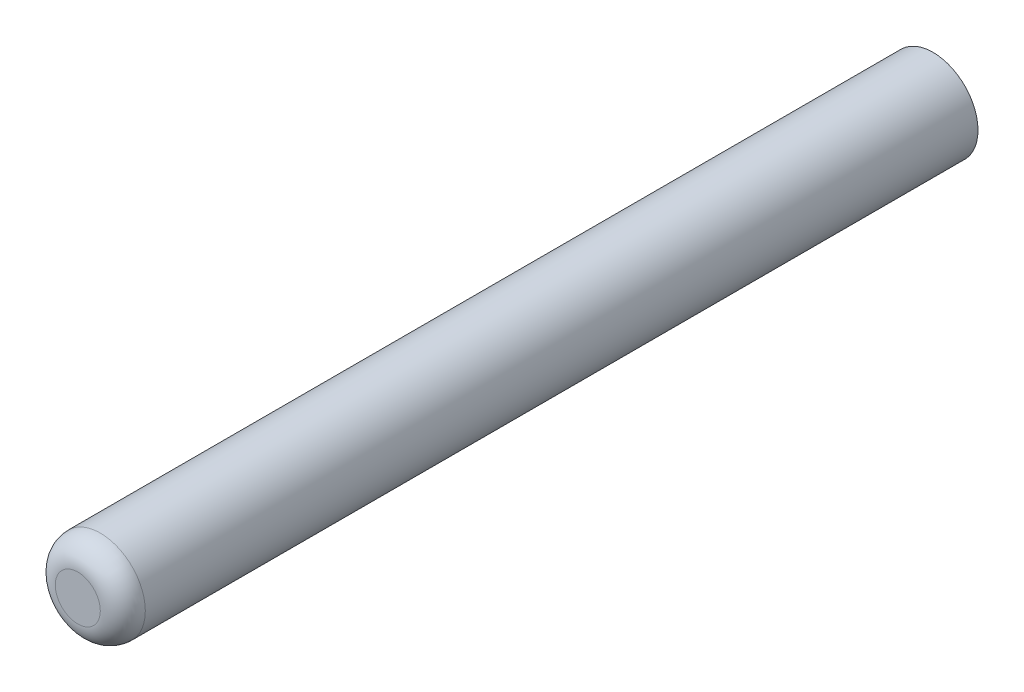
from build123d import *

# Parameters (mm, degrees)
ESQUISSE1_R = 1
AXE_DEPTH   = 9.5
CONG_R      = 0.5


with BuildPart() as part:
    # Esquisse1 → Axe (new, symmetric)
    with BuildSketch(Plane.XY):
        Circle(ESQUISSE1_R)
    extrude(amount=AXE_DEPTH, both=True)

    # Cong
    cong_edges = [part.edges().sort_by_distance(p)[0] for p in [
        (-1, 0, 9.5),
    ]]
    fillet(cong_edges, radius=CONG_R)


solid = part.part
